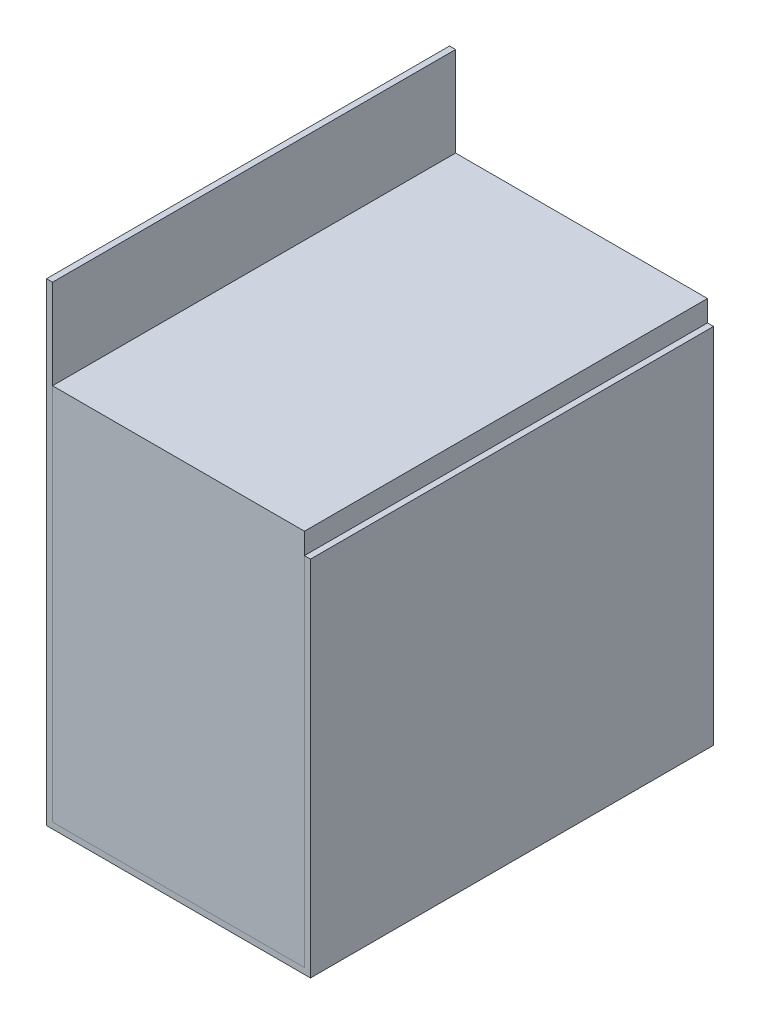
from build123d import *

# Parameters (mm, degrees)
BOSS_EXTRU_1_DEPTH = 200
ESQUISSE2_W        = 250
ESQUISSE2_H        = 375
BOSS_EXTRU_2_DEPTH = 200


with BuildPart() as part:
    # Esquisse1 → Boss.-Extru.1 (new, symmetric)
    with BuildSketch(Plane.XY):
        Polygon((0, -470), (262, -470), (262, -110), (256, -110), (256, -464), (6, -464), (6, 0), (0, 0), align=None)
    extrude(amount=BOSS_EXTRU_1_DEPTH, both=True)


with BuildPart() as body_2:
    # Esquisse2 → Boss.-Extru.2 (new, symmetric)
    with BuildSketch(Plane.XY):
        with Locations((131, -276.5)):
            Rectangle(ESQUISSE2_W, ESQUISSE2_H)
    extrude(amount=BOSS_EXTRU_2_DEPTH, both=True)


solid = Compound([part.part, body_2.part])
